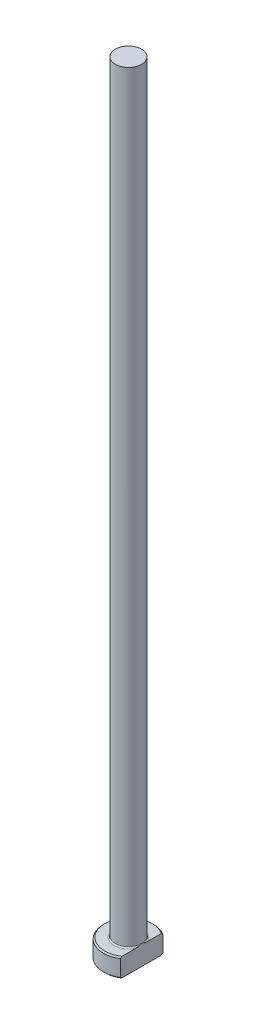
from build123d import *
from build123d.topology import SkipClean

# Parameters (mm, degrees)
CHAMFER1_SIZE = 0.2
FILLET1_R     = 0.2
KEY_DEPTH     = 126.127934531


with BuildPart() as part:
    # Sketch1 → Revolve1 (revolve)
    with BuildSketch(Plane.XY, mode=Mode.PRIVATE) as revolve1_sk:
        Polygon((0, 0), (-4, 0), (-4, 3), (-2.1, 3), (-2.1, 125), (0, 125), align=None)
    revolve(revolve1_sk.sketch.rotate(Axis((0, 259.958771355, 0), (0, -1, 0)), 270), axis=Axis((0, 259.958771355, 0), (0, -1, 0)))

    # Chamfer1
    chamfer1_edges = [part.edges().sort_by_distance(p)[0] for p in [
        (0, 3, -4),
        (0, 0, -4),
    ]]
    chamfer(chamfer1_edges, length=CHAMFER1_SIZE)

    # Fillet1
    fillet1_edges = [part.edges().sort_by_distance(p)[0] for p in [
        (0, 3, -2.1),
    ]]
    fillet(fillet1_edges, radius=FILLET1_R)

    # Sketch2 → KEY (cut, through all)
    with SkipClean():  # the faces are left unmerged after this step: merging them gives an invalid solid
        with BuildSketch(Plane(origin=(0, 0, 0), x_dir=(1, 0, 0), z_dir=(0, 1, 0))):
            with BuildLine():
                Line((2.1, 3.404408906), (2.1, -3.404408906))
                ThreePointArc((2.1, -3.404408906), (4, 0), (2.1, 3.404408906))
            make_face()
        extrude(amount=KEY_DEPTH, mode=Mode.SUBTRACT)


solid = part.part
